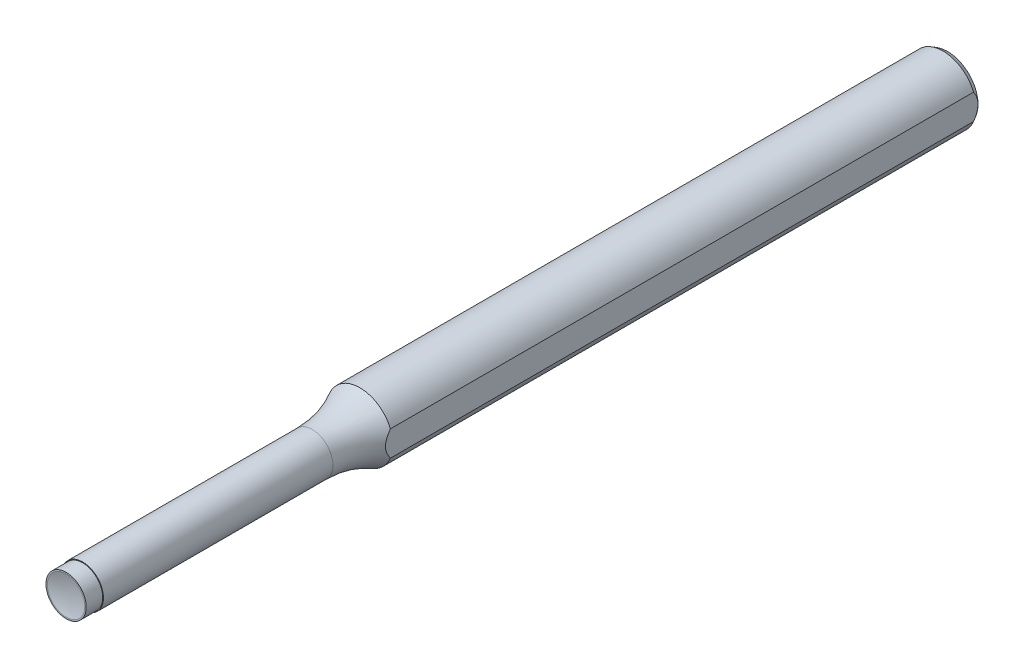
from build123d import *

# Parameters (mm, degrees)
SKETCH1_R           = 4.765
BOSS_EXTRUDE1_DEPTH = 127
SKETCH2_OUTSIDE_W   = 37.072
SKETCH2_OUTSIDE_H   = 37.072
SKETCH2_OUTSIDE_R   = 3
CUT_EXTRUDE1_DEPTH  = 42.333333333
SKETCH3_OUTSIDE_W   = 37.072
SKETCH3_OUTSIDE_H   = 37.072
SKETCH3_OUTSIDE_R   = 2.9
CUT_EXTRUDE2_DEPTH  = 2.3825
CHAMFER1_SIZE       = 0.635333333
CHAMFER1_SIZE2      = 0.366809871
SKETCH7_W           = 3.666687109
SKETCH7_H           = 3.66668711
CUT_EXTRUDE3_DEPTH  = 128.178655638


with BuildPart() as part:
    # Sketch1 → Boss-Extrude1 (new body)
    with BuildSketch(Plane.XY):
        Circle(SKETCH1_R)
    extrude(amount=-BOSS_EXTRUDE1_DEPTH)

    # Sketch2 outside → Cut-Extrude1 (cut)
    with BuildSketch(Plane.XY):
        Rectangle(SKETCH2_OUTSIDE_W, SKETCH2_OUTSIDE_H)
        Circle(SKETCH2_OUTSIDE_R, mode=Mode.SUBTRACT)
    extrude(amount=-CUT_EXTRUDE1_DEPTH, mode=Mode.SUBTRACT)

    # Sketch3 outside → Cut-Extrude2 (cut)
    with BuildSketch(Plane.XY):
        Rectangle(SKETCH3_OUTSIDE_W, SKETCH3_OUTSIDE_H)
        Circle(SKETCH3_OUTSIDE_R, mode=Mode.SUBTRACT)
    extrude(amount=-CUT_EXTRUDE2_DEPTH, mode=Mode.SUBTRACT)

    # Sketch4 → Cut-Revolve1 (revolve, cut)
    with BuildSketch(Plane(origin=(0, 0, 0), x_dir=(0, 0, -1), z_dir=(1, 0, 0))):
        with BuildLine():
            Line((0, 0), (0, 2.7))
            ThreePointArc((0, 2.7), (0.292351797, 1.364044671), (0.390475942, 0))
            Line((0.390475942, 0), (0, 0))
        make_face()
    revolve(axis=Axis((0, 0, 0), (0, 0, -1)), mode=Mode.SUBTRACT)

    # Chamfer1
    chamfer1_edges = [part.edges().sort_by_distance(p)[0] for p in [
        (-4.765, 0, -127),
    ]]
    chamfer1_side = [part.faces().sort_by_distance(p)[0] for p in [
        (-4.765, 0, -84.666666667),
    ]]
    chamfer(chamfer1_edges, length=CHAMFER1_SIZE, length2=CHAMFER1_SIZE2, reference=chamfer1_side[0])

    # Sketch5 → Revolve1 (revolve)
    with BuildSketch(Plane(origin=(0, 0, 0), x_dir=(0, 0, -1), z_dir=(1, 0, 0)), mode=Mode.PRIVATE) as revolve1_sk:
        with BuildLine():
            Line((42.333333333, 0), (35.452481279, 0))
            Line((35.452481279, 0), (35.452481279, 3))
            ThreePointArc((35.452481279, 3), (39.004288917, 3.448278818), (42.333333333, 4.765))
            Line((42.333333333, 4.765), (42.333333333, 0))
        make_face()
    revolve(revolve1_sk.sketch.rotate(Axis((0, 0, -42.333333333), (0, 0, 1)), 270), axis=Axis((0, 0, -42.333333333), (0, 0, 1)))

    # Sketch7 → Cut-Extrude3 (cut, through all)
    with BuildSketch(Plane(origin=(0, 0, -127), x_dir=(-1, 0, 0), z_dir=(0, 0, -1))):
        with Locations((-6.231533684, 0)):
            Rectangle(SKETCH7_W, SKETCH7_H)
    extrude(amount=-CUT_EXTRUDE3_DEPTH, mode=Mode.SUBTRACT)


solid = part.part
